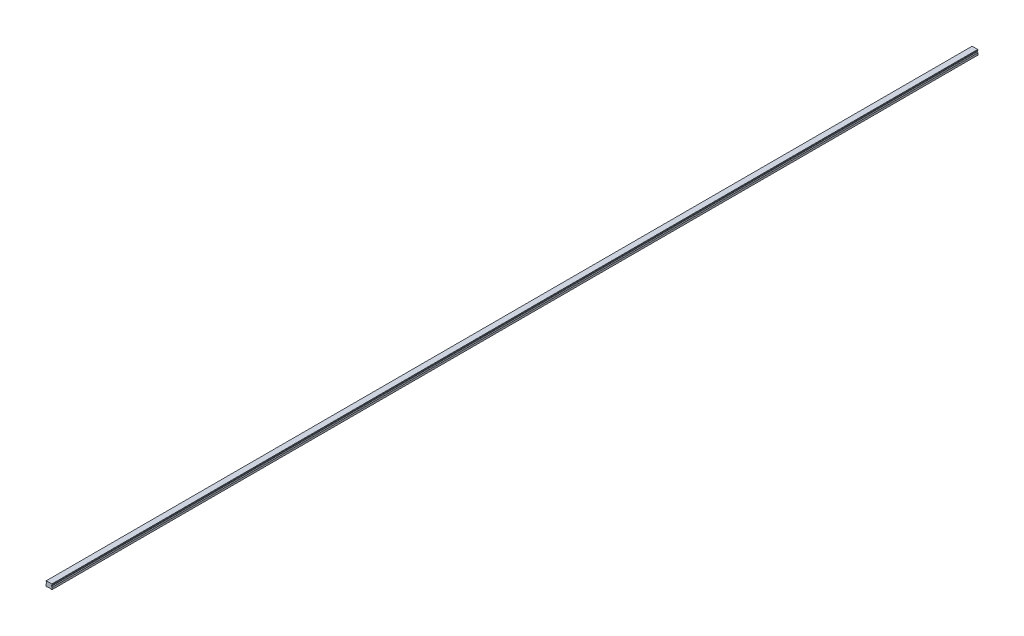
from build123d import *

# Parameters (mm, degrees)
SKETCH1_W           = 20
SKETCH1_H           = 16.3
BOSS_EXTRUDE1_DEPTH = 1490
CUT_EXTRUDE1_DEPTH  = 2981.061356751
CHAMFER1_SIZE       = 1
FILLET1_R           = 1
CUT_EXTRUDE2_DEPTH  = 2981.061356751
SKETCH5_R           = 3
SKETCH5_R_2         = 2.5
CUT_EXTRUDE5_DEPTH  = 10
SKETCH5_2_R         = 2.5
CUT_EXTRUDE6_DEPTH  = 13
LPATTERN2_COUNT     = 50
LPATTERN2_PITCH     = 60


with BuildPart() as part:
    # Sketch1 → Boss-Extrude1 (new, symmetric)
    with BuildSketch(Plane.XY):
        with Locations((0, 8.15)):
            Rectangle(SKETCH1_W, SKETCH1_H)
    extrude(amount=BOSS_EXTRUDE1_DEPTH, both=True)

    # Sketch2 → Cut-Extrude1 (cut, through all)
    with BuildSketch(Plane.XY.offset(1490)):
        Polygon((-10, 14.3), (-10, 7.3), (-7.666666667, 9.633333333), (-7.666666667, 11.966666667), align=None)
        Polygon((7.666666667, 11.966666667), (10, 14.3), (10, 7.3), (7.666666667, 9.633333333), align=None)
    extrude(amount=-CUT_EXTRUDE1_DEPTH, mode=Mode.SUBTRACT)

    # Chamfer1
    chamfer1_edges = [part.edges().sort_by_distance(p)[0] for p in [
        (-10, 16.3, 0),
        (10, 16.3, 0),
        (10, 0, 0),
        (-10, 0, 0),
    ]]
    chamfer(chamfer1_edges, length=CHAMFER1_SIZE)

    # Fillet1
    fillet1_edges = [part.edges().sort_by_distance(p)[0] for p in [
        (-7.666666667, 11.966666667, 0),
        (-7.666666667, 9.633333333, 0),
        (7.666666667, 9.633333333, 0),
        (7.666666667, 11.966666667, 0),
    ]]
    fillet(fillet1_edges, radius=FILLET1_R)

    # Sketch3 → Cut-Extrude2 (cut, through all)
    with BuildSketch(Plane.XY.offset(1490)):
        Polygon((-6, 0), (-5, 1), (5, 1), (6, 0), align=None)
    extrude(amount=-CUT_EXTRUDE2_DEPTH, mode=Mode.SUBTRACT)

    # Sketch5 → Cut-Extrude5 (cut)
    with BuildSketch(Plane.XZ.offset(-1)):
        with Locations(Location((0, 1470, 0), (0, 0, 270))):
            Circle(SKETCH5_R)
        with Locations(Location((0, 1470, 0), (0, 0, 270))):
            Circle(SKETCH5_R_2, mode=Mode.SUBTRACT)
    cut_extrude5 = extrude(amount=-CUT_EXTRUDE5_DEPTH, mode=Mode.SUBTRACT)

    # Sketch5_2 → Cut-Extrude6 (cut)
    with BuildSketch(Plane.XZ.offset(-1)):
        with Locations(Location((0, 1470, 0), (0, 0, 270))):
            Circle(SKETCH5_2_R)
    cut_extrude6 = extrude(amount=-CUT_EXTRUDE6_DEPTH, mode=Mode.SUBTRACT)

    # Cut-Extrude7 cone 1 section (on through the dimple's axis) → Cut-Extrude7 (revolve, cut)
    with BuildSketch(Plane(origin=(0, 14, 1470), x_dir=(0, 0, -1), z_dir=(1, 0, 0))):
        Polygon((0, 0), (2.5, 0), (0, 1.443375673), align=None)
    cut_extrude7 = revolve(axis=Axis((0, 14, 1470), (0, 1, 0)), mode=Mode.SUBTRACT)

    # LPattern2: Cut-Extrude5, Cut-Extrude6, Cut-Extrude7 ×50
    with Locations(*[(0, 0, -i * LPATTERN2_PITCH) for i in range(1, LPATTERN2_COUNT)]):
        add(cut_extrude5, mode=Mode.SUBTRACT)
        add(cut_extrude6, mode=Mode.SUBTRACT)
        add(cut_extrude7, mode=Mode.SUBTRACT)


solid = part.part
